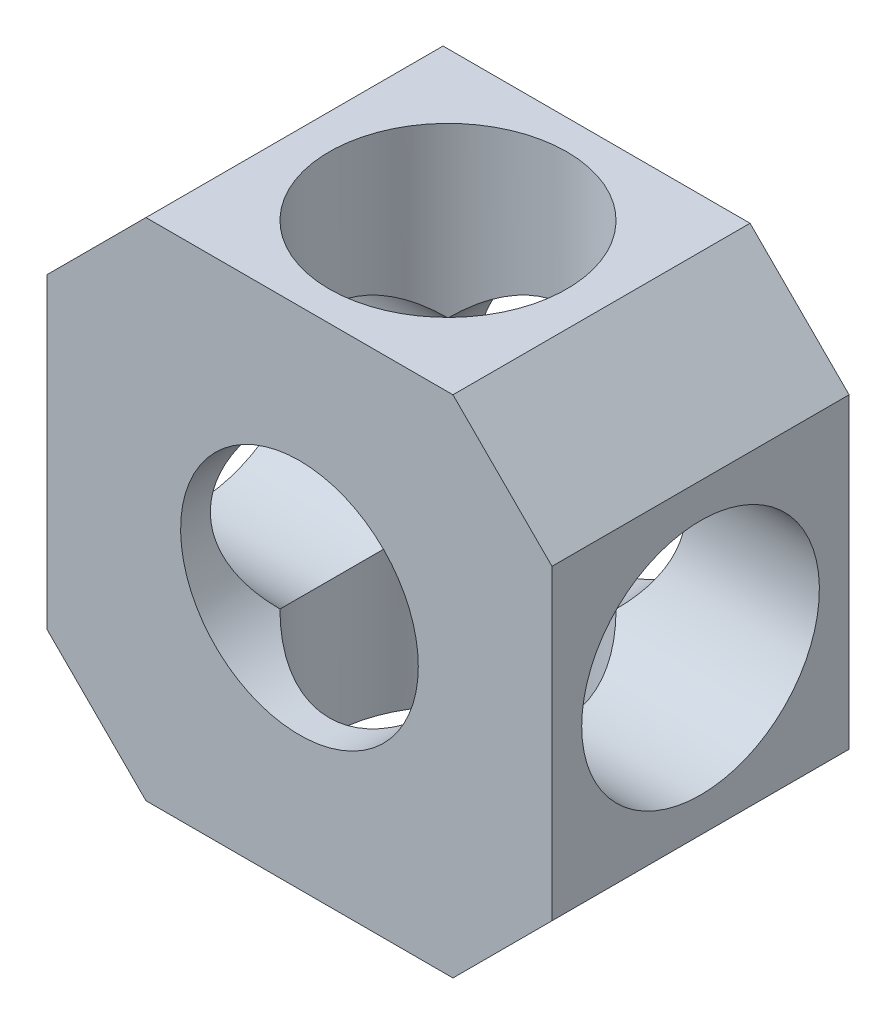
ISO-10303-21;
HEADER;
FILE_DESCRIPTION(('STEP AP214'),'2;1');
FILE_NAME('part.step','',(''),(''),'','','');
FILE_SCHEMA(('AUTOMOTIVE_DESIGN { 1 0 10303 214 1 1 1 1 }'));
ENDSEC;
DATA;
#1=APPLICATION_CONTEXT('core data for automotive mechanical design processes');
#2=APPLICATION_PROTOCOL_DEFINITION('international standard','automotive_design',2000,#1);
#3=PRODUCT_CONTEXT('',#1,'mechanical');
#4=PRODUCT('Part','Part','',(#3));
#5=PRODUCT_RELATED_PRODUCT_CATEGORY('part','',(#4));
#6=PRODUCT_DEFINITION_FORMATION('','',#4);
#7=PRODUCT_DEFINITION_CONTEXT('part definition',#1,'design');
#8=PRODUCT_DEFINITION('design','',#6,#7);
#9=PRODUCT_DEFINITION_SHAPE('','',#8);
#10=(LENGTH_UNIT() NAMED_UNIT(*) SI_UNIT(.MILLI.,.METRE.));
#11=(NAMED_UNIT(*) PLANE_ANGLE_UNIT() SI_UNIT($,.RADIAN.));
#12=(NAMED_UNIT(*) SI_UNIT($,.STERADIAN.) SOLID_ANGLE_UNIT());
#13=UNCERTAINTY_MEASURE_WITH_UNIT(LENGTH_MEASURE(1.E-05),#10,'distance_accuracy_value','');
#14=(GEOMETRIC_REPRESENTATION_CONTEXT(3) GLOBAL_UNCERTAINTY_ASSIGNED_CONTEXT((#13)) GLOBAL_UNIT_ASSIGNED_CONTEXT((#10,
#11,#12)) REPRESENTATION_CONTEXT('',''));
#15=CARTESIAN_POINT('',(0.,0.,0.));
#16=DIRECTION('',(0.,0.,1.));
#17=DIRECTION('',(1.,0.,0.));
#18=AXIS2_PLACEMENT_3D('',#15,#16,#17);
#19=CARTESIAN_POINT('',(0.,0.,5.625));
#20=DIRECTION('',(0.,0.,-1.));
#21=DIRECTION('',(-1.,0.,0.));
#22=AXIS2_PLACEMENT_3D('',#19,#20,#21);
#23=CYLINDRICAL_SURFACE('',#22,4.5);
#24=CARTESIAN_POINT('',(0.,0.,0.));
#25=DIRECTION('',(0.707106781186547,0.,-0.707106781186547));
#26=DIRECTION('',(-0.707106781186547,0.,-0.707106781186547));
#27=AXIS2_PLACEMENT_3D('',#24,#25,#26);
#28=ELLIPSE('',#27,6.36396103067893,4.5);
#29=CARTESIAN_POINT('',(3.18198051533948,-3.18198051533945,3.18198051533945));
#30=VERTEX_POINT('',#29);
#31=CARTESIAN_POINT('',(3.18198051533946,3.18198051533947,3.18198051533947));
#32=VERTEX_POINT('',#31);
#33=EDGE_CURVE('E62',#30,#32,#28,.F.);
#34=ORIENTED_EDGE('',*,*,#33,.F.);
#35=CARTESIAN_POINT('',(0.,0.,0.));
#36=DIRECTION('',(0.,-0.707106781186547,-0.707106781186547));
#37=DIRECTION('',(0.,0.707106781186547,-0.707106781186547));
#38=AXIS2_PLACEMENT_3D('',#35,#36,#37);
#39=ELLIPSE('',#38,6.36396103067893,4.5);
#40=CARTESIAN_POINT('',(-3.18198051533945,-3.18198051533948,3.18198051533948));
#41=VERTEX_POINT('',#40);
#42=EDGE_CURVE('E140',#41,#30,#39,.F.);
#43=ORIENTED_EDGE('',*,*,#42,.F.);
#44=CARTESIAN_POINT('',(0.,0.,0.));
#45=DIRECTION('',(-0.707106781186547,0.,-0.707106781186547));
#46=DIRECTION('',(0.707106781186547,0.,-0.707106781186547));
#47=AXIS2_PLACEMENT_3D('',#44,#45,#46);
#48=ELLIPSE('',#47,6.36396103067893,4.5);
#49=CARTESIAN_POINT('',(-3.18198051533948,3.18198051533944,3.18198051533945));
#50=VERTEX_POINT('',#49);
#51=EDGE_CURVE('E127',#50,#41,#48,.F.);
#52=ORIENTED_EDGE('',*,*,#51,.F.);
#53=CARTESIAN_POINT('',(0.,0.,0.));
#54=DIRECTION('',(0.,0.707106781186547,-0.707106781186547));
#55=DIRECTION('',(0.,-0.707106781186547,-0.707106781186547));
#56=AXIS2_PLACEMENT_3D('',#53,#54,#55);
#57=ELLIPSE('',#56,6.36396103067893,4.5);
#58=EDGE_CURVE('E134',#32,#50,#57,.F.);
#59=ORIENTED_EDGE('',*,*,#58,.F.);
#60=EDGE_LOOP('',(#34,#43,#52,#59));
#61=FACE_BOUND('',#60,.T.);
#62=CARTESIAN_POINT('',(0.,0.,5.625));
#63=DIRECTION('',(0.,0.,1.));
#64=DIRECTION('',(1.,0.,0.));
#65=AXIS2_PLACEMENT_3D('',#62,#63,#64);
#66=CIRCLE('',#65,4.5);
#67=CARTESIAN_POINT('',(4.5,0.,5.625));
#68=VERTEX_POINT('',#67);
#69=EDGE_CURVE('E217',#68,#68,#66,.T.);
#70=ORIENTED_EDGE('',*,*,#69,.T.);
#71=EDGE_LOOP('',(#70));
#72=FACE_BOUND('',#71,.T.);
#73=ADVANCED_FACE('F38',(#61,#72),#23,.F.);
#74=CARTESIAN_POINT('',(0.,0.,5.625));
#75=DIRECTION('',(0.,0.,1.));
#76=DIRECTION('',(1.,0.,0.));
#77=AXIS2_PLACEMENT_3D('',#74,#75,#76);
#78=PLANE('',#77);
#79=DIRECTION('',(-0.707106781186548,0.707106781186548,0.));
#80=VECTOR('',#79,1.);
#81=CARTESIAN_POINT('',(5.8125,9.5625,5.625));
#82=LINE('',#81,#80);
#83=CARTESIAN_POINT('',(9.5625,5.8125,5.625));
#84=VERTEX_POINT('',#83);
#85=CARTESIAN_POINT('',(5.8125,9.5625,5.625));
#86=VERTEX_POINT('',#85);
#87=EDGE_CURVE('E194',#84,#86,#82,.T.);
#88=ORIENTED_EDGE('',*,*,#87,.T.);
#89=DIRECTION('',(-1.,0.,0.));
#90=VECTOR('',#89,1.);
#91=CARTESIAN_POINT('',(-5.8125,9.5625,5.625));
#92=LINE('',#91,#90);
#93=CARTESIAN_POINT('',(-5.8125,9.5625,5.625));
#94=VERTEX_POINT('',#93);
#95=EDGE_CURVE('E235',#86,#94,#92,.T.);
#96=ORIENTED_EDGE('',*,*,#95,.T.);
#97=DIRECTION('',(-0.707106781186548,-0.707106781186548,0.));
#98=VECTOR('',#97,1.);
#99=CARTESIAN_POINT('',(-9.5625,5.8125,5.625));
#100=LINE('',#99,#98);
#101=CARTESIAN_POINT('',(-9.5625,5.8125,5.625));
#102=VERTEX_POINT('',#101);
#103=EDGE_CURVE('E232',#94,#102,#100,.T.);
#104=ORIENTED_EDGE('',*,*,#103,.T.);
#105=DIRECTION('',(0.,-1.,0.));
#106=VECTOR('',#105,1.);
#107=CARTESIAN_POINT('',(-9.5625,5.8125,5.625));
#108=LINE('',#107,#106);
#109=CARTESIAN_POINT('',(-9.5625,-5.8125,5.625));
#110=VERTEX_POINT('',#109);
#111=EDGE_CURVE('E229',#102,#110,#108,.T.);
#112=ORIENTED_EDGE('',*,*,#111,.T.);
#113=DIRECTION('',(0.707106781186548,-0.707106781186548,0.));
#114=VECTOR('',#113,1.);
#115=CARTESIAN_POINT('',(-9.5625,-5.8125,5.625));
#116=LINE('',#115,#114);
#117=CARTESIAN_POINT('',(-5.8125,-9.5625,5.625));
#118=VERTEX_POINT('',#117);
#119=EDGE_CURVE('E226',#110,#118,#116,.T.);
#120=ORIENTED_EDGE('',*,*,#119,.T.);
#121=DIRECTION('',(1.,0.,0.));
#122=VECTOR('',#121,1.);
#123=CARTESIAN_POINT('',(-5.8125,-9.5625,5.625));
#124=LINE('',#123,#122);
#125=CARTESIAN_POINT('',(5.8125,-9.5625,5.625));
#126=VERTEX_POINT('',#125);
#127=EDGE_CURVE('E223',#118,#126,#124,.T.);
#128=ORIENTED_EDGE('',*,*,#127,.T.);
#129=DIRECTION('',(0.707106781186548,0.707106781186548,0.));
#130=VECTOR('',#129,1.);
#131=CARTESIAN_POINT('',(5.8125,-9.5625,5.625));
#132=LINE('',#131,#130);
#133=CARTESIAN_POINT('',(9.5625,-5.8125,5.625));
#134=VERTEX_POINT('',#133);
#135=EDGE_CURVE('E220',#126,#134,#132,.T.);
#136=ORIENTED_EDGE('',*,*,#135,.T.);
#137=DIRECTION('',(0.,1.,0.));
#138=VECTOR('',#137,1.);
#139=CARTESIAN_POINT('',(9.5625,5.8125,5.625));
#140=LINE('',#139,#138);
#141=EDGE_CURVE('E190',#134,#84,#140,.T.);
#142=ORIENTED_EDGE('',*,*,#141,.T.);
#143=EDGE_LOOP('',(#88,#96,#104,#112,#120,#128,#136,#142));
#144=FACE_BOUND('',#143,.T.);
#145=ORIENTED_EDGE('',*,*,#69,.F.);
#146=EDGE_LOOP('',(#145));
#147=FACE_BOUND('',#146,.T.);
#148=ADVANCED_FACE('F314',(#144,#147),#78,.T.);
#149=CARTESIAN_POINT('',(0.,0.,-5.625));
#150=DIRECTION('',(0.,0.,1.));
#151=DIRECTION('',(1.,0.,0.));
#152=AXIS2_PLACEMENT_3D('',#149,#150,#151);
#153=PLANE('',#152);
#154=DIRECTION('',(-0.707106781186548,0.707106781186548,0.));
#155=VECTOR('',#154,1.);
#156=CARTESIAN_POINT('',(5.8125,9.5625,-5.625));
#157=LINE('',#156,#155);
#158=CARTESIAN_POINT('',(9.5625,5.8125,-5.625));
#159=VERTEX_POINT('',#158);
#160=CARTESIAN_POINT('',(5.8125,9.5625,-5.625));
#161=VERTEX_POINT('',#160);
#162=EDGE_CURVE('E213',#159,#161,#157,.T.);
#163=ORIENTED_EDGE('',*,*,#162,.F.);
#164=DIRECTION('',(0.,1.,0.));
#165=VECTOR('',#164,1.);
#166=CARTESIAN_POINT('',(9.5625,5.8125,-5.625));
#167=LINE('',#166,#165);
#168=CARTESIAN_POINT('',(9.5625,-5.8125,-5.625));
#169=VERTEX_POINT('',#168);
#170=EDGE_CURVE('E191',#169,#159,#167,.T.);
#171=ORIENTED_EDGE('',*,*,#170,.F.);
#172=DIRECTION('',(0.707106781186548,0.707106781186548,0.));
#173=VECTOR('',#172,1.);
#174=CARTESIAN_POINT('',(5.8125,-9.5625,-5.625));
#175=LINE('',#174,#173);
#176=CARTESIAN_POINT('',(5.8125,-9.5625,-5.625));
#177=VERTEX_POINT('',#176);
#178=EDGE_CURVE('E195',#177,#169,#175,.T.);
#179=ORIENTED_EDGE('',*,*,#178,.F.);
#180=DIRECTION('',(1.,0.,0.));
#181=VECTOR('',#180,1.);
#182=CARTESIAN_POINT('',(-5.8125,-9.5625,-5.625));
#183=LINE('',#182,#181);
#184=CARTESIAN_POINT('',(-5.8125,-9.5625,-5.625));
#185=VERTEX_POINT('',#184);
#186=EDGE_CURVE('E198',#185,#177,#183,.T.);
#187=ORIENTED_EDGE('',*,*,#186,.F.);
#188=DIRECTION('',(0.707106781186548,-0.707106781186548,0.));
#189=VECTOR('',#188,1.);
#190=CARTESIAN_POINT('',(-9.5625,-5.8125,-5.625));
#191=LINE('',#190,#189);
#192=CARTESIAN_POINT('',(-9.5625,-5.8125,-5.625));
#193=VERTEX_POINT('',#192);
#194=EDGE_CURVE('E201',#193,#185,#191,.T.);
#195=ORIENTED_EDGE('',*,*,#194,.F.);
#196=DIRECTION('',(0.,-1.,0.));
#197=VECTOR('',#196,1.);
#198=CARTESIAN_POINT('',(-9.5625,5.8125,-5.625));
#199=LINE('',#198,#197);
#200=CARTESIAN_POINT('',(-9.5625,5.8125,-5.625));
#201=VERTEX_POINT('',#200);
#202=EDGE_CURVE('E204',#201,#193,#199,.T.);
#203=ORIENTED_EDGE('',*,*,#202,.F.);
#204=DIRECTION('',(-0.707106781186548,-0.707106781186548,0.));
#205=VECTOR('',#204,1.);
#206=CARTESIAN_POINT('',(-9.5625,5.8125,-5.625));
#207=LINE('',#206,#205);
#208=CARTESIAN_POINT('',(-5.8125,9.5625,-5.625));
#209=VERTEX_POINT('',#208);
#210=EDGE_CURVE('E207',#209,#201,#207,.T.);
#211=ORIENTED_EDGE('',*,*,#210,.F.);
#212=DIRECTION('',(-1.,0.,0.));
#213=VECTOR('',#212,1.);
#214=CARTESIAN_POINT('',(-5.8125,9.5625,-5.625));
#215=LINE('',#214,#213);
#216=EDGE_CURVE('E210',#161,#209,#215,.T.);
#217=ORIENTED_EDGE('',*,*,#216,.F.);
#218=EDGE_LOOP('',(#163,#171,#179,#187,#195,#203,#211,#217));
#219=FACE_BOUND('',#218,.T.);
#220=CARTESIAN_POINT('',(0.,0.,-5.625));
#221=DIRECTION('',(0.,0.,1.));
#222=DIRECTION('',(1.,0.,0.));
#223=AXIS2_PLACEMENT_3D('',#220,#221,#222);
#224=CIRCLE('',#223,4.5);
#225=CARTESIAN_POINT('',(4.5,0.,-5.625));
#226=VERTEX_POINT('',#225);
#227=EDGE_CURVE('E241',#226,#226,#224,.T.);
#228=ORIENTED_EDGE('',*,*,#227,.T.);
#229=EDGE_LOOP('',(#228));
#230=FACE_BOUND('',#229,.T.);
#231=ADVANCED_FACE('F305',(#219,#230),#153,.F.);
#232=CARTESIAN_POINT('',(5.8125,9.5625,5.625));
#233=DIRECTION('',(-0.707106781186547,-0.707106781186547,0.));
#234=DIRECTION('',(0.707106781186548,-0.707106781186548,0.));
#235=AXIS2_PLACEMENT_3D('',#232,#233,#234);
#236=PLANE('',#235);
#237=ORIENTED_EDGE('',*,*,#162,.T.);
#238=DIRECTION('',(0.,0.,-1.));
#239=VECTOR('',#238,1.);
#240=CARTESIAN_POINT('',(5.8125,9.5625,5.625));
#241=LINE('',#240,#239);
#242=EDGE_CURVE('E158',#86,#161,#241,.T.);
#243=ORIENTED_EDGE('',*,*,#242,.F.);
#244=ORIENTED_EDGE('',*,*,#87,.F.);
#245=DIRECTION('',(0.,0.,-1.));
#246=VECTOR('',#245,1.);
#247=CARTESIAN_POINT('',(9.5625,5.8125,5.625));
#248=LINE('',#247,#246);
#249=EDGE_CURVE('E186',#84,#159,#248,.T.);
#250=ORIENTED_EDGE('',*,*,#249,.T.);
#251=EDGE_LOOP('',(#237,#243,#244,#250));
#252=FACE_BOUND('',#251,.T.);
#253=ADVANCED_FACE('F40',(#252),#236,.F.);
#254=CARTESIAN_POINT('',(-5.8125,9.5625,5.625));
#255=DIRECTION('',(0.,-1.,0.));
#256=DIRECTION('',(0.,0.,-1.));
#257=AXIS2_PLACEMENT_3D('',#254,#255,#256);
#258=PLANE('',#257);
#259=CARTESIAN_POINT('',(0.,9.5625,0.));
#260=DIRECTION('',(0.,1.,0.));
#261=DIRECTION('',(0.,0.,1.));
#262=AXIS2_PLACEMENT_3D('',#259,#260,#261);
#263=CIRCLE('',#262,4.5);
#264=CARTESIAN_POINT('',(0.,9.5625,4.5));
#265=VERTEX_POINT('',#264);
#266=EDGE_CURVE('E249',#265,#265,#263,.T.);
#267=ORIENTED_EDGE('',*,*,#266,.F.);
#268=EDGE_LOOP('',(#267));
#269=FACE_BOUND('',#268,.T.);
#270=ORIENTED_EDGE('',*,*,#216,.T.);
#271=DIRECTION('',(0.,0.,-1.));
#272=VECTOR('',#271,1.);
#273=CARTESIAN_POINT('',(-5.8125,9.5625,5.625));
#274=LINE('',#273,#272);
#275=EDGE_CURVE('E162',#94,#209,#274,.T.);
#276=ORIENTED_EDGE('',*,*,#275,.F.);
#277=ORIENTED_EDGE('',*,*,#95,.F.);
#278=ORIENTED_EDGE('',*,*,#242,.T.);
#279=EDGE_LOOP('',(#270,#276,#277,#278));
#280=FACE_BOUND('',#279,.T.);
#281=ADVANCED_FACE('F311',(#269,#280),#258,.F.);
#282=CARTESIAN_POINT('',(-9.5625,5.8125,5.625));
#283=DIRECTION('',(0.707106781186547,-0.707106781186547,0.));
#284=DIRECTION('',(0.707106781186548,0.707106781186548,0.));
#285=AXIS2_PLACEMENT_3D('',#282,#283,#284);
#286=PLANE('',#285);
#287=ORIENTED_EDGE('',*,*,#210,.T.);
#288=DIRECTION('',(0.,0.,-1.));
#289=VECTOR('',#288,1.);
#290=CARTESIAN_POINT('',(-9.5625,5.8125,5.625));
#291=LINE('',#290,#289);
#292=EDGE_CURVE('E166',#102,#201,#291,.T.);
#293=ORIENTED_EDGE('',*,*,#292,.F.);
#294=ORIENTED_EDGE('',*,*,#103,.F.);
#295=ORIENTED_EDGE('',*,*,#275,.T.);
#296=EDGE_LOOP('',(#287,#293,#294,#295));
#297=FACE_BOUND('',#296,.T.);
#298=ADVANCED_FACE('F334',(#297),#286,.F.);
#299=CARTESIAN_POINT('',(-9.5625,5.8125,5.625));
#300=DIRECTION('',(1.,0.,0.));
#301=DIRECTION('',(0.,1.,0.));
#302=AXIS2_PLACEMENT_3D('',#299,#300,#301);
#303=PLANE('',#302);
#304=CARTESIAN_POINT('',(-9.5625,0.,0.));
#305=DIRECTION('',(-1.,0.,0.));
#306=DIRECTION('',(0.,0.,1.));
#307=AXIS2_PLACEMENT_3D('',#304,#305,#306);
#308=CIRCLE('',#307,4.5);
#309=CARTESIAN_POINT('',(-9.5625,0.,4.5));
#310=VERTEX_POINT('',#309);
#311=EDGE_CURVE('E263',#310,#310,#308,.T.);
#312=ORIENTED_EDGE('',*,*,#311,.F.);
#313=EDGE_LOOP('',(#312));
#314=FACE_BOUND('',#313,.T.);
#315=ORIENTED_EDGE('',*,*,#202,.T.);
#316=DIRECTION('',(0.,0.,-1.));
#317=VECTOR('',#316,1.);
#318=CARTESIAN_POINT('',(-9.5625,-5.8125,5.625));
#319=LINE('',#318,#317);
#320=EDGE_CURVE('E170',#110,#193,#319,.T.);
#321=ORIENTED_EDGE('',*,*,#320,.F.);
#322=ORIENTED_EDGE('',*,*,#111,.F.);
#323=ORIENTED_EDGE('',*,*,#292,.T.);
#324=EDGE_LOOP('',(#315,#321,#322,#323));
#325=FACE_BOUND('',#324,.T.);
#326=ADVANCED_FACE('F331',(#314,#325),#303,.F.);
#327=CARTESIAN_POINT('',(-9.5625,-5.8125,5.625));
#328=DIRECTION('',(0.707106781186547,0.707106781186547,0.));
#329=DIRECTION('',(-0.707106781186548,0.707106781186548,0.));
#330=AXIS2_PLACEMENT_3D('',#327,#328,#329);
#331=PLANE('',#330);
#332=ORIENTED_EDGE('',*,*,#194,.T.);
#333=DIRECTION('',(0.,0.,-1.));
#334=VECTOR('',#333,1.);
#335=CARTESIAN_POINT('',(-5.8125,-9.5625,5.625));
#336=LINE('',#335,#334);
#337=EDGE_CURVE('E174',#118,#185,#336,.T.);
#338=ORIENTED_EDGE('',*,*,#337,.F.);
#339=ORIENTED_EDGE('',*,*,#119,.F.);
#340=ORIENTED_EDGE('',*,*,#320,.T.);
#341=EDGE_LOOP('',(#332,#338,#339,#340));
#342=FACE_BOUND('',#341,.T.);
#343=ADVANCED_FACE('F327',(#342),#331,.F.);
#344=CARTESIAN_POINT('',(-5.8125,-9.5625,5.625));
#345=DIRECTION('',(0.,1.,0.));
#346=DIRECTION('',(0.,0.,1.));
#347=AXIS2_PLACEMENT_3D('',#344,#345,#346);
#348=PLANE('',#347);
#349=CARTESIAN_POINT('',(0.,-9.5625,0.));
#350=DIRECTION('',(0.,1.,0.));
#351=DIRECTION('',(0.,0.,1.));
#352=AXIS2_PLACEMENT_3D('',#349,#350,#351);
#353=CIRCLE('',#352,4.5);
#354=CARTESIAN_POINT('',(0.,-9.5625,4.5));
#355=VERTEX_POINT('',#354);
#356=EDGE_CURVE('E245',#355,#355,#353,.T.);
#357=ORIENTED_EDGE('',*,*,#356,.T.);
#358=EDGE_LOOP('',(#357));
#359=FACE_BOUND('',#358,.T.);
#360=ORIENTED_EDGE('',*,*,#186,.T.);
#361=DIRECTION('',(0.,0.,-1.));
#362=VECTOR('',#361,1.);
#363=CARTESIAN_POINT('',(5.8125,-9.5625,5.625));
#364=LINE('',#363,#362);
#365=EDGE_CURVE('E178',#126,#177,#364,.T.);
#366=ORIENTED_EDGE('',*,*,#365,.F.);
#367=ORIENTED_EDGE('',*,*,#127,.F.);
#368=ORIENTED_EDGE('',*,*,#337,.T.);
#369=EDGE_LOOP('',(#360,#366,#367,#368));
#370=FACE_BOUND('',#369,.T.);
#371=ADVANCED_FACE('F323',(#359,#370),#348,.F.);
#372=CARTESIAN_POINT('',(5.8125,-9.5625,5.625));
#373=DIRECTION('',(-0.707106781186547,0.707106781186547,0.));
#374=DIRECTION('',(-0.707106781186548,-0.707106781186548,0.));
#375=AXIS2_PLACEMENT_3D('',#372,#373,#374);
#376=PLANE('',#375);
#377=ORIENTED_EDGE('',*,*,#178,.T.);
#378=DIRECTION('',(0.,0.,-1.));
#379=VECTOR('',#378,1.);
#380=CARTESIAN_POINT('',(9.5625,-5.8125,5.625));
#381=LINE('',#380,#379);
#382=EDGE_CURVE('E182',#134,#169,#381,.T.);
#383=ORIENTED_EDGE('',*,*,#382,.F.);
#384=ORIENTED_EDGE('',*,*,#135,.F.);
#385=ORIENTED_EDGE('',*,*,#365,.T.);
#386=EDGE_LOOP('',(#377,#383,#384,#385));
#387=FACE_BOUND('',#386,.T.);
#388=ADVANCED_FACE('F293',(#387),#376,.F.);
#389=CARTESIAN_POINT('',(9.5625,5.8125,5.625));
#390=DIRECTION('',(-1.,0.,0.));
#391=DIRECTION('',(0.,0.,1.));
#392=AXIS2_PLACEMENT_3D('',#389,#390,#391);
#393=PLANE('',#392);
#394=CARTESIAN_POINT('',(9.56250000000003,0.,0.));
#395=DIRECTION('',(-1.,0.,0.));
#396=DIRECTION('',(0.,0.,1.));
#397=AXIS2_PLACEMENT_3D('',#394,#395,#396);
#398=CIRCLE('',#397,4.5);
#399=CARTESIAN_POINT('',(9.56250000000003,0.,4.5));
#400=VERTEX_POINT('',#399);
#401=EDGE_CURVE('E262',#400,#400,#398,.T.);
#402=ORIENTED_EDGE('',*,*,#401,.T.);
#403=EDGE_LOOP('',(#402));
#404=FACE_BOUND('',#403,.T.);
#405=ORIENTED_EDGE('',*,*,#170,.T.);
#406=ORIENTED_EDGE('',*,*,#249,.F.);
#407=ORIENTED_EDGE('',*,*,#141,.F.);
#408=ORIENTED_EDGE('',*,*,#382,.T.);
#409=EDGE_LOOP('',(#405,#406,#407,#408));
#410=FACE_BOUND('',#409,.T.);
#411=ADVANCED_FACE('F290',(#404,#410),#393,.F.);
#412=CARTESIAN_POINT('',(0.,0.,0.));
#413=DIRECTION('',(-0.707106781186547,0.,-0.707106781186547));
#414=DIRECTION('',(0.707106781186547,0.,-0.707106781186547));
#415=AXIS2_PLACEMENT_3D('',#412,#413,#414);
#416=ELLIPSE('',#415,6.36396103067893,4.5);
#417=CARTESIAN_POINT('',(3.18198051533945,3.18198051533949,-3.18198051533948));
#418=VERTEX_POINT('',#417);
#419=CARTESIAN_POINT('',(3.18198051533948,-3.18198051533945,-3.18198051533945));
#420=VERTEX_POINT('',#419);
#421=EDGE_CURVE('E142',#418,#420,#416,.T.);
#422=ORIENTED_EDGE('',*,*,#421,.F.);
#423=CARTESIAN_POINT('',(0.,0.,0.));
#424=DIRECTION('',(0.,-0.707106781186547,-0.707106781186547));
#425=DIRECTION('',(0.,0.707106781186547,-0.707106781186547));
#426=AXIS2_PLACEMENT_3D('',#423,#424,#425);
#427=ELLIPSE('',#426,6.36396103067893,4.5);
#428=CARTESIAN_POINT('',(-3.18198051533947,3.18198051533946,-3.18198051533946));
#429=VERTEX_POINT('',#428);
#430=EDGE_CURVE('E151',#429,#418,#427,.T.);
#431=ORIENTED_EDGE('',*,*,#430,.F.);
#432=CARTESIAN_POINT('',(0.,0.,0.));
#433=DIRECTION('',(0.707106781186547,0.,-0.707106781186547));
#434=DIRECTION('',(-0.707106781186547,0.,-0.707106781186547));
#435=AXIS2_PLACEMENT_3D('',#432,#433,#434);
#436=ELLIPSE('',#435,6.36396103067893,4.5);
#437=CARTESIAN_POINT('',(-3.18198051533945,-3.18198051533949,-3.18198051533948));
#438=VERTEX_POINT('',#437);
#439=EDGE_CURVE('E54',#438,#429,#436,.T.);
#440=ORIENTED_EDGE('',*,*,#439,.F.);
#441=CARTESIAN_POINT('',(0.,0.,0.));
#442=DIRECTION('',(0.,0.707106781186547,-0.707106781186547));
#443=DIRECTION('',(0.,-0.707106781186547,-0.707106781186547));
#444=AXIS2_PLACEMENT_3D('',#441,#442,#443);
#445=ELLIPSE('',#444,6.36396103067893,4.5);
#446=EDGE_CURVE('E147',#420,#438,#445,.T.);
#447=ORIENTED_EDGE('',*,*,#446,.F.);
#448=EDGE_LOOP('',(#422,#431,#440,#447));
#449=FACE_BOUND('',#448,.T.);
#450=ORIENTED_EDGE('',*,*,#227,.F.);
#451=EDGE_LOOP('',(#450));
#452=FACE_BOUND('',#451,.T.);
#453=ADVANCED_FACE('F282',(#449,#452),#23,.F.);
#454=CARTESIAN_POINT('',(0.,-9.5625,0.));
#455=DIRECTION('',(0.,1.,0.));
#456=DIRECTION('',(0.,0.,1.));
#457=AXIS2_PLACEMENT_3D('',#454,#455,#456);
#458=CYLINDRICAL_SURFACE('',#457,4.5);
#459=ORIENTED_EDGE('',*,*,#42,.T.);
#460=CARTESIAN_POINT('',(0.,0.,0.));
#461=DIRECTION('',(-0.707106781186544,-0.707106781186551,0.));
#462=DIRECTION('',(0.707106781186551,-0.707106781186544,0.));
#463=AXIS2_PLACEMENT_3D('',#460,#461,#462);
#464=ELLIPSE('',#463,6.36396103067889,4.5);
#465=EDGE_CURVE('E273',#30,#420,#464,.F.);
#466=ORIENTED_EDGE('',*,*,#465,.T.);
#467=ORIENTED_EDGE('',*,*,#446,.T.);
#468=CARTESIAN_POINT('',(0.,0.,0.));
#469=DIRECTION('',(0.707106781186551,-0.707106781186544,0.));
#470=DIRECTION('',(-0.707106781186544,-0.707106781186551,0.));
#471=AXIS2_PLACEMENT_3D('',#468,#469,#470);
#472=ELLIPSE('',#471,6.36396103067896,4.5);
#473=EDGE_CURVE('E267',#438,#41,#472,.F.);
#474=ORIENTED_EDGE('',*,*,#473,.T.);
#475=EDGE_LOOP('',(#459,#466,#467,#474));
#476=FACE_BOUND('',#475,.T.);
#477=ORIENTED_EDGE('',*,*,#356,.F.);
#478=EDGE_LOOP('',(#477));
#479=FACE_BOUND('',#478,.T.);
#480=ADVANCED_FACE('F278',(#476,#479),#458,.F.);
#481=ORIENTED_EDGE('',*,*,#430,.T.);
#482=CARTESIAN_POINT('',(0.,0.,0.));
#483=DIRECTION('',(-0.707106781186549,0.707106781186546,0.));
#484=DIRECTION('',(0.707106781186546,0.707106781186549,0.));
#485=AXIS2_PLACEMENT_3D('',#482,#483,#484);
#486=ELLIPSE('',#485,6.36396103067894,4.5);
#487=EDGE_CURVE('E11',#418,#32,#486,.F.);
#488=ORIENTED_EDGE('',*,*,#487,.T.);
#489=ORIENTED_EDGE('',*,*,#58,.T.);
#490=CARTESIAN_POINT('',(0.,0.,0.));
#491=DIRECTION('',(0.707106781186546,0.707106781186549,0.));
#492=DIRECTION('',(-0.707106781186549,0.707106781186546,0.));
#493=AXIS2_PLACEMENT_3D('',#490,#491,#492);
#494=ELLIPSE('',#493,6.36396103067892,4.5);
#495=EDGE_CURVE('E47',#50,#429,#494,.F.);
#496=ORIENTED_EDGE('',*,*,#495,.T.);
#497=EDGE_LOOP('',(#481,#488,#489,#496));
#498=FACE_BOUND('',#497,.T.);
#499=ORIENTED_EDGE('',*,*,#266,.T.);
#500=EDGE_LOOP('',(#499));
#501=FACE_BOUND('',#500,.T.);
#502=ADVANCED_FACE('F144',(#498,#501),#458,.F.);
#503=CARTESIAN_POINT('',(9.56250000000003,0.,0.));
#504=DIRECTION('',(-1.,0.,0.));
#505=DIRECTION('',(0.,-1.,0.));
#506=AXIS2_PLACEMENT_3D('',#503,#504,#505);
#507=CYLINDRICAL_SURFACE('',#506,4.5);
#508=ORIENTED_EDGE('',*,*,#51,.T.);
#509=ORIENTED_EDGE('',*,*,#473,.F.);
#510=ORIENTED_EDGE('',*,*,#439,.T.);
#511=ORIENTED_EDGE('',*,*,#495,.F.);
#512=EDGE_LOOP('',(#508,#509,#510,#511));
#513=FACE_BOUND('',#512,.T.);
#514=ORIENTED_EDGE('',*,*,#311,.T.);
#515=EDGE_LOOP('',(#514));
#516=FACE_BOUND('',#515,.T.);
#517=ADVANCED_FACE('F125',(#513,#516),#507,.F.);
#518=ORIENTED_EDGE('',*,*,#33,.T.);
#519=ORIENTED_EDGE('',*,*,#487,.F.);
#520=ORIENTED_EDGE('',*,*,#421,.T.);
#521=ORIENTED_EDGE('',*,*,#465,.F.);
#522=EDGE_LOOP('',(#518,#519,#520,#521));
#523=FACE_BOUND('',#522,.T.);
#524=ORIENTED_EDGE('',*,*,#401,.F.);
#525=EDGE_LOOP('',(#524));
#526=FACE_BOUND('',#525,.T.);
#527=ADVANCED_FACE('F284',(#523,#526),#507,.F.);
#528=CLOSED_SHELL('',(#73,#148,#231,#253,#281,#298,#326,#343,#371,#388,#411,#453,#480,#502,#517,#527));
#529=MANIFOLD_SOLID_BREP('B2',#528);
#530=ADVANCED_BREP_SHAPE_REPRESENTATION('',(#18,#529),#14);
#531=SHAPE_DEFINITION_REPRESENTATION(#9,#530);
ENDSEC;
END-ISO-10303-21;
